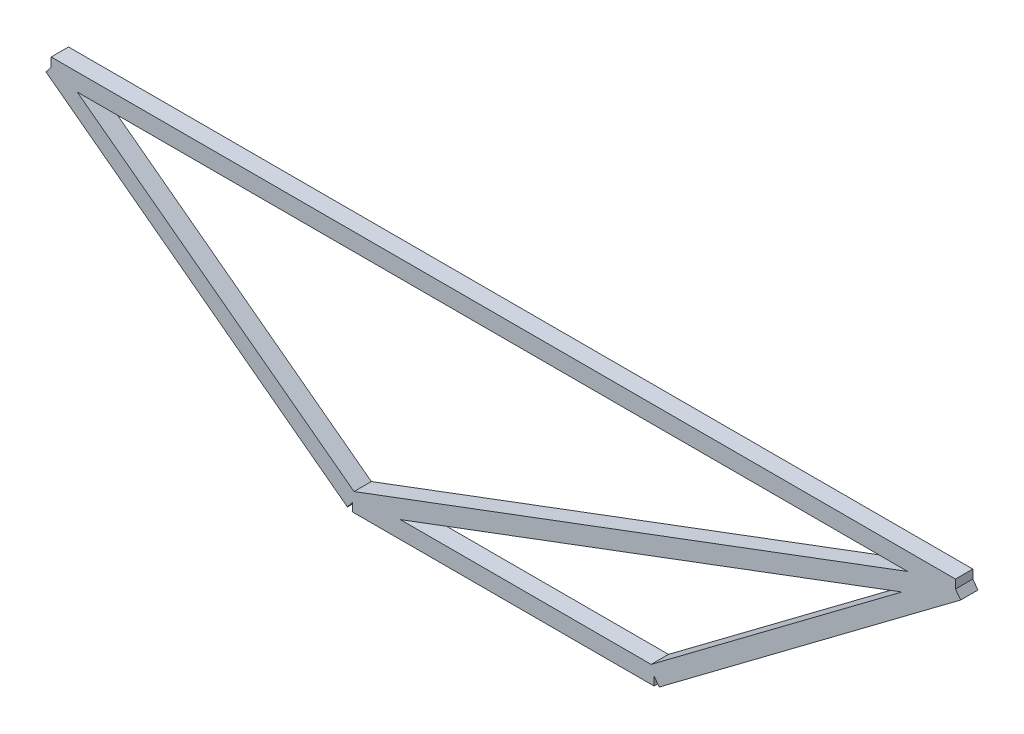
ISO-10303-21;
HEADER;
FILE_DESCRIPTION(('STEP AP214'),'2;1');
FILE_NAME('part.step','',(''),(''),'','','');
FILE_SCHEMA(('AUTOMOTIVE_DESIGN { 1 0 10303 214 1 1 1 1 }'));
ENDSEC;
DATA;
#1=APPLICATION_CONTEXT('core data for automotive mechanical design processes');
#2=APPLICATION_PROTOCOL_DEFINITION('international standard','automotive_design',2000,#1);
#3=PRODUCT_CONTEXT('',#1,'mechanical');
#4=PRODUCT('Part','Part','',(#3));
#5=PRODUCT_RELATED_PRODUCT_CATEGORY('part','',(#4));
#6=PRODUCT_DEFINITION_FORMATION('','',#4);
#7=PRODUCT_DEFINITION_CONTEXT('part definition',#1,'design');
#8=PRODUCT_DEFINITION('design','',#6,#7);
#9=PRODUCT_DEFINITION_SHAPE('','',#8);
#10=(LENGTH_UNIT() NAMED_UNIT(*) SI_UNIT(.MILLI.,.METRE.));
#11=(NAMED_UNIT(*) PLANE_ANGLE_UNIT() SI_UNIT($,.RADIAN.));
#12=(NAMED_UNIT(*) SI_UNIT($,.STERADIAN.) SOLID_ANGLE_UNIT());
#13=UNCERTAINTY_MEASURE_WITH_UNIT(LENGTH_MEASURE(1.E-05),#10,'distance_accuracy_value','');
#14=(GEOMETRIC_REPRESENTATION_CONTEXT(3) GLOBAL_UNCERTAINTY_ASSIGNED_CONTEXT((#13)) GLOBAL_UNIT_ASSIGNED_CONTEXT((#10,
#11,#12)) REPRESENTATION_CONTEXT('',''));
#15=CARTESIAN_POINT('',(0.,0.,0.));
#16=DIRECTION('',(0.,0.,1.));
#17=DIRECTION('',(1.,0.,0.));
#18=AXIS2_PLACEMENT_3D('',#15,#16,#17);
#19=CARTESIAN_POINT('',(1200.,-11.5,23.));
#20=DIRECTION('',(0.,1.,0.));
#21=DIRECTION('',(0.,0.,1.));
#22=AXIS2_PLACEMENT_3D('',#19,#20,#21);
#23=PLANE('',#22);
#24=DIRECTION('',(0.,0.,-1.));
#25=VECTOR('',#24,1.);
#26=CARTESIAN_POINT('',(1136.58131897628,-11.5,23.));
#27=LINE('',#26,#25);
#28=CARTESIAN_POINT('',(1136.58131897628,-11.4999999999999,23.));
#29=VERTEX_POINT('',#28);
#30=CARTESIAN_POINT('',(1136.58131897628,-11.4999999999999,0.));
#31=VERTEX_POINT('',#30);
#32=EDGE_CURVE('E61',#29,#31,#27,.T.);
#33=ORIENTED_EDGE('',*,*,#32,.F.);
#34=DIRECTION('',(1.,0.,0.));
#35=VECTOR('',#34,1.);
#36=CARTESIAN_POINT('',(1200.,-11.5,23.));
#37=LINE('',#36,#35);
#38=CARTESIAN_POINT('',(34.5,-11.5,23.));
#39=VERTEX_POINT('',#38);
#40=EDGE_CURVE('E198',#39,#29,#37,.T.);
#41=ORIENTED_EDGE('',*,*,#40,.F.);
#42=DIRECTION('',(0.,0.,1.));
#43=VECTOR('',#42,1.);
#44=CARTESIAN_POINT('',(34.5,-11.5,23.));
#45=LINE('',#44,#43);
#46=CARTESIAN_POINT('',(34.5,-11.5,0.));
#47=VERTEX_POINT('',#46);
#48=EDGE_CURVE('E179',#47,#39,#45,.T.);
#49=ORIENTED_EDGE('',*,*,#48,.F.);
#50=DIRECTION('',(1.,0.,0.));
#51=VECTOR('',#50,1.);
#52=CARTESIAN_POINT('',(1200.,-11.5,0.));
#53=LINE('',#52,#51);
#54=EDGE_CURVE('E326',#47,#31,#53,.T.);
#55=ORIENTED_EDGE('',*,*,#54,.T.);
#56=EDGE_LOOP('',(#33,#41,#49,#55));
#57=FACE_BOUND('',#56,.T.);
#58=ADVANCED_FACE('F44',(#57),#23,.F.);
#59=CARTESIAN_POINT('',(400.,-288.5,23.));
#60=DIRECTION('',(0.,-1.,0.));
#61=DIRECTION('',(0.,0.,-1.));
#62=AXIS2_PLACEMENT_3D('',#59,#60,#61);
#63=PLANE('',#62);
#64=DIRECTION('',(0.,0.,-1.));
#65=VECTOR('',#64,1.);
#66=CARTESIAN_POINT('',(463.418681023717,-288.5,23.));
#67=LINE('',#66,#65);
#68=CARTESIAN_POINT('',(463.418681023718,-288.5,23.));
#69=VERTEX_POINT('',#68);
#70=CARTESIAN_POINT('',(463.418681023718,-288.5,0.));
#71=VERTEX_POINT('',#70);
#72=EDGE_CURVE('E66',#69,#71,#67,.T.);
#73=ORIENTED_EDGE('',*,*,#72,.F.);
#74=DIRECTION('',(-1.,0.,0.));
#75=VECTOR('',#74,1.);
#76=CARTESIAN_POINT('',(400.,-288.5,23.));
#77=LINE('',#76,#75);
#78=CARTESIAN_POINT('',(796.166666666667,-288.5,23.));
#79=VERTEX_POINT('',#78);
#80=EDGE_CURVE('E257',#79,#69,#77,.T.);
#81=ORIENTED_EDGE('',*,*,#80,.F.);
#82=DIRECTION('',(0.,0.,1.));
#83=VECTOR('',#82,1.);
#84=CARTESIAN_POINT('',(796.166666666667,-288.5,23.));
#85=LINE('',#84,#83);
#86=CARTESIAN_POINT('',(796.166666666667,-288.5,0.));
#87=VERTEX_POINT('',#86);
#88=EDGE_CURVE('E354',#87,#79,#85,.T.);
#89=ORIENTED_EDGE('',*,*,#88,.F.);
#90=DIRECTION('',(-1.,0.,0.));
#91=VECTOR('',#90,1.);
#92=CARTESIAN_POINT('',(400.,-288.5,0.));
#93=LINE('',#92,#91);
#94=EDGE_CURVE('E251',#87,#71,#93,.T.);
#95=ORIENTED_EDGE('',*,*,#94,.T.);
#96=EDGE_LOOP('',(#73,#81,#89,#95));
#97=FACE_BOUND('',#96,.T.);
#98=ADVANCED_FACE('F427',(#97),#63,.F.);
#99=CARTESIAN_POINT('',(6.9,9.2,23.));
#100=DIRECTION('',(-0.6,-0.8,0.));
#101=DIRECTION('',(0.8,-0.6,0.));
#102=AXIS2_PLACEMENT_3D('',#99,#100,#101);
#103=PLANE('',#102);
#104=DIRECTION('',(0.,0.,1.));
#105=VECTOR('',#104,1.);
#106=CARTESIAN_POINT('',(401.860439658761,-287.020329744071,23.));
#107=LINE('',#106,#105);
#108=CARTESIAN_POINT('',(401.860439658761,-287.020329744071,0.));
#109=VERTEX_POINT('',#108);
#110=CARTESIAN_POINT('',(401.860439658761,-287.020329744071,23.));
#111=VERTEX_POINT('',#110);
#112=EDGE_CURVE('E174',#109,#111,#107,.T.);
#113=ORIENTED_EDGE('',*,*,#112,.F.);
#114=DIRECTION('',(-0.8,0.6,0.));
#115=VECTOR('',#114,1.);
#116=CARTESIAN_POINT('',(6.9,9.2,0.));
#117=LINE('',#116,#115);
#118=EDGE_CURVE('E287',#109,#47,#117,.T.);
#119=ORIENTED_EDGE('',*,*,#118,.T.);
#120=ORIENTED_EDGE('',*,*,#48,.T.);
#121=DIRECTION('',(-0.8,0.6,0.));
#122=VECTOR('',#121,1.);
#123=CARTESIAN_POINT('',(6.9,9.2,23.));
#124=LINE('',#123,#122);
#125=EDGE_CURVE('E175',#111,#39,#124,.T.);
#126=ORIENTED_EDGE('',*,*,#125,.F.);
#127=EDGE_LOOP('',(#113,#119,#120,#126));
#128=FACE_BOUND('',#127,.T.);
#129=ADVANCED_FACE('F173',(#128),#103,.F.);
#130=CARTESIAN_POINT('',(793.1,-290.8,23.));
#131=DIRECTION('',(0.6,-0.8,0.));
#132=DIRECTION('',(0.8,0.6,0.));
#133=AXIS2_PLACEMENT_3D('',#130,#131,#132);
#134=PLANE('',#133);
#135=DIRECTION('',(0.,0.,1.));
#136=VECTOR('',#135,1.);
#137=CARTESIAN_POINT('',(1128.91465230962,-38.9390107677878,23.));
#138=LINE('',#137,#136);
#139=CARTESIAN_POINT('',(1128.91465230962,-38.9390107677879,0.));
#140=VERTEX_POINT('',#139);
#141=CARTESIAN_POINT('',(1128.91465230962,-38.9390107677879,23.));
#142=VERTEX_POINT('',#141);
#143=EDGE_CURVE('E11',#140,#142,#138,.T.);
#144=ORIENTED_EDGE('',*,*,#143,.F.);
#145=DIRECTION('',(-0.8,-0.6,0.));
#146=VECTOR('',#145,1.);
#147=CARTESIAN_POINT('',(793.1,-290.8,0.));
#148=LINE('',#147,#146);
#149=EDGE_CURVE('E218',#140,#87,#148,.T.);
#150=ORIENTED_EDGE('',*,*,#149,.T.);
#151=ORIENTED_EDGE('',*,*,#88,.T.);
#152=DIRECTION('',(-0.8,-0.6,0.));
#153=VECTOR('',#152,1.);
#154=CARTESIAN_POINT('',(793.1,-290.8,23.));
#155=LINE('',#154,#153);
#156=EDGE_CURVE('E226',#142,#79,#155,.T.);
#157=ORIENTED_EDGE('',*,*,#156,.F.);
#158=EDGE_LOOP('',(#144,#150,#151,#157));
#159=FACE_BOUND('',#158,.T.);
#160=ADVANCED_FACE('F424',(#159),#134,.F.);
#161=CARTESIAN_POINT('',(1200.,11.5,23.));
#162=DIRECTION('',(-1.,0.,0.));
#163=DIRECTION('',(0.,0.,1.));
#164=AXIS2_PLACEMENT_3D('',#161,#162,#163);
#165=PLANE('',#164);
#166=DIRECTION('',(0.,0.,1.));
#167=VECTOR('',#166,1.);
#168=CARTESIAN_POINT('',(1200.,0.,23.));
#169=LINE('',#168,#167);
#170=CARTESIAN_POINT('',(1200.,0.,0.));
#171=VERTEX_POINT('',#170);
#172=CARTESIAN_POINT('',(1200.,0.,23.));
#173=VERTEX_POINT('',#172);
#174=EDGE_CURVE('E53',#171,#173,#169,.T.);
#175=ORIENTED_EDGE('',*,*,#174,.F.);
#176=DIRECTION('',(0.,1.,0.));
#177=VECTOR('',#176,1.);
#178=CARTESIAN_POINT('',(1200.,11.5,0.));
#179=LINE('',#178,#177);
#180=CARTESIAN_POINT('',(1200.,11.5,0.));
#181=VERTEX_POINT('',#180);
#182=EDGE_CURVE('E328',#171,#181,#179,.T.);
#183=ORIENTED_EDGE('',*,*,#182,.T.);
#184=DIRECTION('',(0.,0.,-1.));
#185=VECTOR('',#184,1.);
#186=CARTESIAN_POINT('',(1200.,11.5,23.));
#187=LINE('',#186,#185);
#188=CARTESIAN_POINT('',(1200.,11.5,23.));
#189=VERTEX_POINT('',#188);
#190=EDGE_CURVE('E340',#189,#181,#187,.T.);
#191=ORIENTED_EDGE('',*,*,#190,.F.);
#192=DIRECTION('',(0.,1.,0.));
#193=VECTOR('',#192,1.);
#194=CARTESIAN_POINT('',(1200.,11.5,23.));
#195=LINE('',#194,#193);
#196=EDGE_CURVE('E320',#173,#189,#195,.T.);
#197=ORIENTED_EDGE('',*,*,#196,.F.);
#198=EDGE_LOOP('',(#175,#183,#191,#197));
#199=FACE_BOUND('',#198,.T.);
#200=ADVANCED_FACE('F379',(#199),#165,.F.);
#201=CARTESIAN_POINT('',(800.,-288.5,23.));
#202=DIRECTION('',(-1.,0.,0.));
#203=DIRECTION('',(0.,0.,1.));
#204=AXIS2_PLACEMENT_3D('',#201,#202,#203);
#205=PLANE('',#204);
#206=DIRECTION('',(0.,0.,-1.));
#207=VECTOR('',#206,1.);
#208=CARTESIAN_POINT('',(800.,-300.,23.));
#209=LINE('',#208,#207);
#210=CARTESIAN_POINT('',(800.,-300.,23.));
#211=VERTEX_POINT('',#210);
#212=CARTESIAN_POINT('',(800.,-300.,0.));
#213=VERTEX_POINT('',#212);
#214=EDGE_CURVE('E351',#211,#213,#209,.T.);
#215=ORIENTED_EDGE('',*,*,#214,.F.);
#216=DIRECTION('',(0.,1.,0.));
#217=VECTOR('',#216,1.);
#218=CARTESIAN_POINT('',(800.,-288.5,23.));
#219=LINE('',#218,#217);
#220=CARTESIAN_POINT('',(800.,-311.5,23.));
#221=VERTEX_POINT('',#220);
#222=EDGE_CURVE('E258',#221,#211,#219,.T.);
#223=ORIENTED_EDGE('',*,*,#222,.F.);
#224=DIRECTION('',(0.,0.,-1.));
#225=VECTOR('',#224,1.);
#226=CARTESIAN_POINT('',(800.,-311.5,23.));
#227=LINE('',#226,#225);
#228=CARTESIAN_POINT('',(800.,-311.5,0.));
#229=VERTEX_POINT('',#228);
#230=EDGE_CURVE('E263',#221,#229,#227,.T.);
#231=ORIENTED_EDGE('',*,*,#230,.T.);
#232=DIRECTION('',(0.,1.,0.));
#233=VECTOR('',#232,1.);
#234=CARTESIAN_POINT('',(800.,-288.5,0.));
#235=LINE('',#234,#233);
#236=EDGE_CURVE('E267',#229,#213,#235,.T.);
#237=ORIENTED_EDGE('',*,*,#236,.T.);
#238=EDGE_LOOP('',(#215,#223,#231,#237));
#239=FACE_BOUND('',#238,.T.);
#240=ADVANCED_FACE('F411',(#239),#205,.F.);
#241=CARTESIAN_POINT('',(406.9,-290.8,23.));
#242=DIRECTION('',(-0.799999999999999,0.600000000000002,0.));
#243=DIRECTION('',(-0.600000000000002,-0.799999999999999,0.));
#244=AXIS2_PLACEMENT_3D('',#241,#242,#243);
#245=PLANE('',#244);
#246=DIRECTION('',(0.,0.,-1.));
#247=VECTOR('',#246,1.);
#248=CARTESIAN_POINT('',(400.,-300.,23.));
#249=LINE('',#248,#247);
#250=CARTESIAN_POINT('',(400.,-300.,23.));
#251=VERTEX_POINT('',#250);
#252=CARTESIAN_POINT('',(400.,-300.,0.));
#253=VERTEX_POINT('',#252);
#254=EDGE_CURVE('E350',#251,#253,#249,.T.);
#255=ORIENTED_EDGE('',*,*,#254,.F.);
#256=DIRECTION('',(0.600000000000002,0.799999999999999,0.));
#257=VECTOR('',#256,1.);
#258=CARTESIAN_POINT('',(406.9,-290.8,23.));
#259=LINE('',#258,#257);
#260=CARTESIAN_POINT('',(393.1,-309.2,23.));
#261=VERTEX_POINT('',#260);
#262=EDGE_CURVE('E181',#261,#251,#259,.T.);
#263=ORIENTED_EDGE('',*,*,#262,.F.);
#264=DIRECTION('',(0.,0.,-1.));
#265=VECTOR('',#264,1.);
#266=CARTESIAN_POINT('',(393.1,-309.2,23.));
#267=LINE('',#266,#265);
#268=CARTESIAN_POINT('',(393.1,-309.2,0.));
#269=VERTEX_POINT('',#268);
#270=EDGE_CURVE('E185',#261,#269,#267,.T.);
#271=ORIENTED_EDGE('',*,*,#270,.T.);
#272=DIRECTION('',(0.600000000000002,0.799999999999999,0.));
#273=VECTOR('',#272,1.);
#274=CARTESIAN_POINT('',(406.9,-290.8,0.));
#275=LINE('',#274,#273);
#276=EDGE_CURVE('E300',#269,#253,#275,.T.);
#277=ORIENTED_EDGE('',*,*,#276,.T.);
#278=EDGE_LOOP('',(#255,#263,#271,#277));
#279=FACE_BOUND('',#278,.T.);
#280=ADVANCED_FACE('F418',(#279),#245,.F.);
#281=CARTESIAN_POINT('',(0.,-11.5,23.));
#282=DIRECTION('',(1.,0.,0.));
#283=DIRECTION('',(0.,0.,-1.));
#284=AXIS2_PLACEMENT_3D('',#281,#282,#283);
#285=PLANE('',#284);
#286=DIRECTION('',(0.,0.,-1.));
#287=VECTOR('',#286,1.);
#288=CARTESIAN_POINT('',(0.,0.,23.));
#289=LINE('',#288,#287);
#290=CARTESIAN_POINT('',(0.,0.,23.));
#291=VERTEX_POINT('',#290);
#292=CARTESIAN_POINT('',(0.,0.,0.));
#293=VERTEX_POINT('',#292);
#294=EDGE_CURVE('E344',#291,#293,#289,.T.);
#295=ORIENTED_EDGE('',*,*,#294,.F.);
#296=DIRECTION('',(0.,-1.,0.));
#297=VECTOR('',#296,1.);
#298=CARTESIAN_POINT('',(0.,-11.5,23.));
#299=LINE('',#298,#297);
#300=CARTESIAN_POINT('',(0.,11.5,23.));
#301=VERTEX_POINT('',#300);
#302=EDGE_CURVE('E309',#301,#291,#299,.T.);
#303=ORIENTED_EDGE('',*,*,#302,.F.);
#304=DIRECTION('',(0.,0.,-1.));
#305=VECTOR('',#304,1.);
#306=CARTESIAN_POINT('',(0.,11.5,23.));
#307=LINE('',#306,#305);
#308=CARTESIAN_POINT('',(0.,11.5,0.));
#309=VERTEX_POINT('',#308);
#310=EDGE_CURVE('E323',#301,#309,#307,.T.);
#311=ORIENTED_EDGE('',*,*,#310,.T.);
#312=DIRECTION('',(0.,-1.,0.));
#313=VECTOR('',#312,1.);
#314=CARTESIAN_POINT('',(0.,-11.5,0.));
#315=LINE('',#314,#313);
#316=EDGE_CURVE('E310',#309,#293,#315,.T.);
#317=ORIENTED_EDGE('',*,*,#316,.T.);
#318=EDGE_LOOP('',(#295,#303,#311,#317));
#319=FACE_BOUND('',#318,.T.);
#320=ADVANCED_FACE('F50',(#319),#285,.F.);
#321=CARTESIAN_POINT('',(0.,11.5,23.));
#322=DIRECTION('',(0.,-1.,0.));
#323=DIRECTION('',(0.,0.,-1.));
#324=AXIS2_PLACEMENT_3D('',#321,#322,#323);
#325=PLANE('',#324);
#326=DIRECTION('',(-1.,0.,0.));
#327=VECTOR('',#326,1.);
#328=CARTESIAN_POINT('',(0.,11.5,0.));
#329=LINE('',#328,#327);
#330=EDGE_CURVE('E314',#181,#309,#329,.T.);
#331=ORIENTED_EDGE('',*,*,#330,.T.);
#332=ORIENTED_EDGE('',*,*,#310,.F.);
#333=DIRECTION('',(-1.,0.,0.));
#334=VECTOR('',#333,1.);
#335=CARTESIAN_POINT('',(0.,11.5,23.));
#336=LINE('',#335,#334);
#337=EDGE_CURVE('E319',#189,#301,#336,.T.);
#338=ORIENTED_EDGE('',*,*,#337,.F.);
#339=ORIENTED_EDGE('',*,*,#190,.T.);
#340=EDGE_LOOP('',(#331,#332,#338,#339));
#341=FACE_BOUND('',#340,.T.);
#342=ADVANCED_FACE('F382',(#341),#325,.F.);
#343=CARTESIAN_POINT('',(0.,0.,23.));
#344=DIRECTION('',(0.,0.,-1.));
#345=DIRECTION('',(-1.,0.,0.));
#346=AXIS2_PLACEMENT_3D('',#343,#344,#345);
#347=PLANE('',#346);
#348=DIRECTION('',(0.936329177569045,0.351123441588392,0.));
#349=VECTOR('',#348,1.);
#350=CARTESIAN_POINT('',(1204.03791957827,-10.767785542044,23.));
#351=LINE('',#350,#349);
#352=EDGE_CURVE('E196',#69,#142,#351,.T.);
#353=ORIENTED_EDGE('',*,*,#352,.T.);
#354=ORIENTED_EDGE('',*,*,#156,.T.);
#355=ORIENTED_EDGE('',*,*,#80,.T.);
#356=EDGE_LOOP('',(#353,#354,#355));
#357=FACE_BOUND('',#356,.T.);
#358=DIRECTION('',(-0.936329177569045,-0.351123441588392,0.));
#359=VECTOR('',#358,1.);
#360=CARTESIAN_POINT('',(395.962080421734,-289.232214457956,23.));
#361=LINE('',#360,#359);
#362=EDGE_CURVE('E188',#29,#111,#361,.T.);
#363=ORIENTED_EDGE('',*,*,#362,.T.);
#364=ORIENTED_EDGE('',*,*,#125,.T.);
#365=ORIENTED_EDGE('',*,*,#40,.T.);
#366=EDGE_LOOP('',(#363,#364,#365));
#367=FACE_BOUND('',#366,.T.);
#368=DIRECTION('',(-0.599999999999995,0.800000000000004,0.));
#369=VECTOR('',#368,1.);
#370=CARTESIAN_POINT('',(1193.1,9.2,23.));
#371=LINE('',#370,#369);
#372=CARTESIAN_POINT('',(1206.9,-9.2,23.));
#373=VERTEX_POINT('',#372);
#374=EDGE_CURVE('E225',#373,#173,#371,.T.);
#375=ORIENTED_EDGE('',*,*,#374,.T.);
#376=ORIENTED_EDGE('',*,*,#196,.T.);
#377=ORIENTED_EDGE('',*,*,#337,.T.);
#378=ORIENTED_EDGE('',*,*,#302,.T.);
#379=DIRECTION('',(-0.6,-0.8,0.));
#380=VECTOR('',#379,1.);
#381=CARTESIAN_POINT('',(-6.9,-9.2,23.));
#382=LINE('',#381,#380);
#383=CARTESIAN_POINT('',(-6.9,-9.2,23.));
#384=VERTEX_POINT('',#383);
#385=EDGE_CURVE('E285',#291,#384,#382,.T.);
#386=ORIENTED_EDGE('',*,*,#385,.T.);
#387=DIRECTION('',(0.8,-0.6,0.));
#388=VECTOR('',#387,1.);
#389=CARTESIAN_POINT('',(393.1,-309.2,23.));
#390=LINE('',#389,#388);
#391=EDGE_CURVE('E284',#384,#261,#390,.T.);
#392=ORIENTED_EDGE('',*,*,#391,.T.);
#393=ORIENTED_EDGE('',*,*,#262,.T.);
#394=DIRECTION('',(0.,-1.,0.));
#395=VECTOR('',#394,1.);
#396=CARTESIAN_POINT('',(400.,-311.5,23.));
#397=LINE('',#396,#395);
#398=CARTESIAN_POINT('',(400.,-311.5,23.));
#399=VERTEX_POINT('',#398);
#400=EDGE_CURVE('E246',#251,#399,#397,.T.);
#401=ORIENTED_EDGE('',*,*,#400,.T.);
#402=DIRECTION('',(1.,0.,0.));
#403=VECTOR('',#402,1.);
#404=CARTESIAN_POINT('',(800.,-311.5,23.));
#405=LINE('',#404,#403);
#406=EDGE_CURVE('E252',#399,#221,#405,.T.);
#407=ORIENTED_EDGE('',*,*,#406,.T.);
#408=ORIENTED_EDGE('',*,*,#222,.T.);
#409=DIRECTION('',(0.600000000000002,-0.799999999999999,0.));
#410=VECTOR('',#409,1.);
#411=CARTESIAN_POINT('',(806.9,-309.2,23.));
#412=LINE('',#411,#410);
#413=CARTESIAN_POINT('',(806.9,-309.2,23.));
#414=VERTEX_POINT('',#413);
#415=EDGE_CURVE('E214',#211,#414,#412,.T.);
#416=ORIENTED_EDGE('',*,*,#415,.T.);
#417=DIRECTION('',(0.8,0.6,0.));
#418=VECTOR('',#417,1.);
#419=CARTESIAN_POINT('',(1206.9,-9.2,23.));
#420=LINE('',#419,#418);
#421=EDGE_CURVE('E217',#414,#373,#420,.T.);
#422=ORIENTED_EDGE('',*,*,#421,.T.);
#423=EDGE_LOOP('',(#375,#376,#377,#378,#386,#392,#393,#401,#407,#408,#416,#422));
#424=FACE_BOUND('',#423,.T.);
#425=ADVANCED_FACE('F191',(#357,#367,#424),#347,.F.);
#426=CARTESIAN_POINT('',(0.,0.,0.));
#427=DIRECTION('',(0.,0.,-1.));
#428=DIRECTION('',(-1.,0.,0.));
#429=AXIS2_PLACEMENT_3D('',#426,#427,#428);
#430=PLANE('',#429);
#431=ORIENTED_EDGE('',*,*,#149,.F.);
#432=DIRECTION('',(0.936329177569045,0.351123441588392,0.));
#433=VECTOR('',#432,1.);
#434=CARTESIAN_POINT('',(1204.03791957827,-10.767785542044,0.));
#435=LINE('',#434,#433);
#436=EDGE_CURVE('E200',#71,#140,#435,.T.);
#437=ORIENTED_EDGE('',*,*,#436,.F.);
#438=ORIENTED_EDGE('',*,*,#94,.F.);
#439=EDGE_LOOP('',(#431,#437,#438));
#440=FACE_BOUND('',#439,.T.);
#441=ORIENTED_EDGE('',*,*,#182,.F.);
#442=DIRECTION('',(-0.599999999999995,0.800000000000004,0.));
#443=VECTOR('',#442,1.);
#444=CARTESIAN_POINT('',(1193.1,9.2,0.));
#445=LINE('',#444,#443);
#446=CARTESIAN_POINT('',(1206.9,-9.2,0.));
#447=VERTEX_POINT('',#446);
#448=EDGE_CURVE('E233',#447,#171,#445,.T.);
#449=ORIENTED_EDGE('',*,*,#448,.F.);
#450=DIRECTION('',(0.8,0.6,0.));
#451=VECTOR('',#450,1.);
#452=CARTESIAN_POINT('',(1206.9,-9.2,0.));
#453=LINE('',#452,#451);
#454=CARTESIAN_POINT('',(806.9,-309.2,0.));
#455=VERTEX_POINT('',#454);
#456=EDGE_CURVE('E235',#455,#447,#453,.T.);
#457=ORIENTED_EDGE('',*,*,#456,.F.);
#458=DIRECTION('',(0.600000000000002,-0.799999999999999,0.));
#459=VECTOR('',#458,1.);
#460=CARTESIAN_POINT('',(806.9,-309.2,0.));
#461=LINE('',#460,#459);
#462=EDGE_CURVE('E212',#213,#455,#461,.T.);
#463=ORIENTED_EDGE('',*,*,#462,.F.);
#464=ORIENTED_EDGE('',*,*,#236,.F.);
#465=DIRECTION('',(1.,0.,0.));
#466=VECTOR('',#465,1.);
#467=CARTESIAN_POINT('',(800.,-311.5,0.));
#468=LINE('',#467,#466);
#469=CARTESIAN_POINT('',(400.,-311.5,0.));
#470=VERTEX_POINT('',#469);
#471=EDGE_CURVE('E266',#470,#229,#468,.T.);
#472=ORIENTED_EDGE('',*,*,#471,.F.);
#473=DIRECTION('',(0.,-1.,0.));
#474=VECTOR('',#473,1.);
#475=CARTESIAN_POINT('',(400.,-311.5,0.));
#476=LINE('',#475,#474);
#477=EDGE_CURVE('E249',#253,#470,#476,.T.);
#478=ORIENTED_EDGE('',*,*,#477,.F.);
#479=ORIENTED_EDGE('',*,*,#276,.F.);
#480=DIRECTION('',(0.8,-0.6,0.));
#481=VECTOR('',#480,1.);
#482=CARTESIAN_POINT('',(393.1,-309.2,0.));
#483=LINE('',#482,#481);
#484=CARTESIAN_POINT('',(-6.9,-9.2,0.));
#485=VERTEX_POINT('',#484);
#486=EDGE_CURVE('E294',#485,#269,#483,.T.);
#487=ORIENTED_EDGE('',*,*,#486,.F.);
#488=DIRECTION('',(-0.6,-0.8,0.));
#489=VECTOR('',#488,1.);
#490=CARTESIAN_POINT('',(-6.9,-9.2,0.));
#491=LINE('',#490,#489);
#492=EDGE_CURVE('E281',#293,#485,#491,.T.);
#493=ORIENTED_EDGE('',*,*,#492,.F.);
#494=ORIENTED_EDGE('',*,*,#316,.F.);
#495=ORIENTED_EDGE('',*,*,#330,.F.);
#496=EDGE_LOOP('',(#441,#449,#457,#463,#464,#472,#478,#479,#487,#493,#494,#495));
#497=FACE_BOUND('',#496,.T.);
#498=DIRECTION('',(-0.936329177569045,-0.351123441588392,0.));
#499=VECTOR('',#498,1.);
#500=CARTESIAN_POINT('',(395.962080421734,-289.232214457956,0.));
#501=LINE('',#500,#499);
#502=EDGE_CURVE('E192',#31,#109,#501,.T.);
#503=ORIENTED_EDGE('',*,*,#502,.F.);
#504=ORIENTED_EDGE('',*,*,#54,.F.);
#505=ORIENTED_EDGE('',*,*,#118,.F.);
#506=EDGE_LOOP('',(#503,#504,#505));
#507=FACE_BOUND('',#506,.T.);
#508=ADVANCED_FACE('F374',(#440,#497,#507),#430,.T.);
#509=CARTESIAN_POINT('',(-6.9,-9.2,23.));
#510=DIRECTION('',(0.8,-0.6,0.));
#511=DIRECTION('',(0.6,0.8,0.));
#512=AXIS2_PLACEMENT_3D('',#509,#510,#511);
#513=PLANE('',#512);
#514=ORIENTED_EDGE('',*,*,#385,.F.);
#515=ORIENTED_EDGE('',*,*,#294,.T.);
#516=ORIENTED_EDGE('',*,*,#492,.T.);
#517=DIRECTION('',(0.,0.,-1.));
#518=VECTOR('',#517,1.);
#519=CARTESIAN_POINT('',(-6.9,-9.2,23.));
#520=LINE('',#519,#518);
#521=EDGE_CURVE('E303',#384,#485,#520,.T.);
#522=ORIENTED_EDGE('',*,*,#521,.F.);
#523=EDGE_LOOP('',(#514,#515,#516,#522));
#524=FACE_BOUND('',#523,.T.);
#525=ADVANCED_FACE('F391',(#524),#513,.F.);
#526=CARTESIAN_POINT('',(393.1,-309.2,23.));
#527=DIRECTION('',(0.6,0.8,0.));
#528=DIRECTION('',(-0.8,0.6,0.));
#529=AXIS2_PLACEMENT_3D('',#526,#527,#528);
#530=PLANE('',#529);
#531=ORIENTED_EDGE('',*,*,#486,.T.);
#532=ORIENTED_EDGE('',*,*,#270,.F.);
#533=ORIENTED_EDGE('',*,*,#391,.F.);
#534=ORIENTED_EDGE('',*,*,#521,.T.);
#535=EDGE_LOOP('',(#531,#532,#533,#534));
#536=FACE_BOUND('',#535,.T.);
#537=ADVANCED_FACE('F394',(#536),#530,.F.);
#538=CARTESIAN_POINT('',(400.,-311.5,23.));
#539=DIRECTION('',(1.,0.,0.));
#540=DIRECTION('',(0.,0.,-1.));
#541=AXIS2_PLACEMENT_3D('',#538,#539,#540);
#542=PLANE('',#541);
#543=ORIENTED_EDGE('',*,*,#400,.F.);
#544=ORIENTED_EDGE('',*,*,#254,.T.);
#545=ORIENTED_EDGE('',*,*,#477,.T.);
#546=DIRECTION('',(0.,0.,-1.));
#547=VECTOR('',#546,1.);
#548=CARTESIAN_POINT('',(400.,-311.5,23.));
#549=LINE('',#548,#547);
#550=EDGE_CURVE('E280',#399,#470,#549,.T.);
#551=ORIENTED_EDGE('',*,*,#550,.F.);
#552=EDGE_LOOP('',(#543,#544,#545,#551));
#553=FACE_BOUND('',#552,.T.);
#554=ADVANCED_FACE('F401',(#553),#542,.F.);
#555=CARTESIAN_POINT('',(800.,-311.5,23.));
#556=DIRECTION('',(0.,1.,0.));
#557=DIRECTION('',(0.,0.,1.));
#558=AXIS2_PLACEMENT_3D('',#555,#556,#557);
#559=PLANE('',#558);
#560=ORIENTED_EDGE('',*,*,#471,.T.);
#561=ORIENTED_EDGE('',*,*,#230,.F.);
#562=ORIENTED_EDGE('',*,*,#406,.F.);
#563=ORIENTED_EDGE('',*,*,#550,.T.);
#564=EDGE_LOOP('',(#560,#561,#562,#563));
#565=FACE_BOUND('',#564,.T.);
#566=ADVANCED_FACE('F410',(#565),#559,.F.);
#567=CARTESIAN_POINT('',(1193.1,9.2,23.));
#568=DIRECTION('',(-0.800000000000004,-0.599999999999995,0.));
#569=DIRECTION('',(0.599999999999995,-0.800000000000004,0.));
#570=AXIS2_PLACEMENT_3D('',#567,#568,#569);
#571=PLANE('',#570);
#572=ORIENTED_EDGE('',*,*,#448,.T.);
#573=ORIENTED_EDGE('',*,*,#174,.T.);
#574=ORIENTED_EDGE('',*,*,#374,.F.);
#575=DIRECTION('',(0.,0.,-1.));
#576=VECTOR('',#575,1.);
#577=CARTESIAN_POINT('',(1206.9,-9.2,23.));
#578=LINE('',#577,#576);
#579=EDGE_CURVE('E228',#373,#447,#578,.T.);
#580=ORIENTED_EDGE('',*,*,#579,.T.);
#581=EDGE_LOOP('',(#572,#573,#574,#580));
#582=FACE_BOUND('',#581,.T.);
#583=ADVANCED_FACE('F362',(#582),#571,.F.);
#584=CARTESIAN_POINT('',(806.9,-309.2,23.));
#585=DIRECTION('',(0.799999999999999,0.600000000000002,0.));
#586=DIRECTION('',(-0.600000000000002,0.799999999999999,0.));
#587=AXIS2_PLACEMENT_3D('',#584,#585,#586);
#588=PLANE('',#587);
#589=ORIENTED_EDGE('',*,*,#415,.F.);
#590=ORIENTED_EDGE('',*,*,#214,.T.);
#591=ORIENTED_EDGE('',*,*,#462,.T.);
#592=DIRECTION('',(0.,0.,-1.));
#593=VECTOR('',#592,1.);
#594=CARTESIAN_POINT('',(806.9,-309.2,23.));
#595=LINE('',#594,#593);
#596=EDGE_CURVE('E243',#414,#455,#595,.T.);
#597=ORIENTED_EDGE('',*,*,#596,.F.);
#598=EDGE_LOOP('',(#589,#590,#591,#597));
#599=FACE_BOUND('',#598,.T.);
#600=ADVANCED_FACE('F415',(#599),#588,.F.);
#601=CARTESIAN_POINT('',(1206.9,-9.2,23.));
#602=DIRECTION('',(-0.6,0.8,0.));
#603=DIRECTION('',(-0.8,-0.6,0.));
#604=AXIS2_PLACEMENT_3D('',#601,#602,#603);
#605=PLANE('',#604);
#606=ORIENTED_EDGE('',*,*,#456,.T.);
#607=ORIENTED_EDGE('',*,*,#579,.F.);
#608=ORIENTED_EDGE('',*,*,#421,.F.);
#609=ORIENTED_EDGE('',*,*,#596,.T.);
#610=EDGE_LOOP('',(#606,#607,#608,#609));
#611=FACE_BOUND('',#610,.T.);
#612=ADVANCED_FACE('F375',(#611),#605,.F.);
#613=CARTESIAN_POINT('',(395.962080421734,-289.232214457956,23.));
#614=DIRECTION('',(0.351123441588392,-0.936329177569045,0.));
#615=DIRECTION('',(0.936329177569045,0.351123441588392,0.));
#616=AXIS2_PLACEMENT_3D('',#613,#614,#615);
#617=PLANE('',#616);
#618=ORIENTED_EDGE('',*,*,#362,.F.);
#619=ORIENTED_EDGE('',*,*,#32,.T.);
#620=ORIENTED_EDGE('',*,*,#502,.T.);
#621=ORIENTED_EDGE('',*,*,#112,.T.);
#622=EDGE_LOOP('',(#618,#619,#620,#621));
#623=FACE_BOUND('',#622,.T.);
#624=ADVANCED_FACE('F187',(#623),#617,.F.);
#625=CARTESIAN_POINT('',(1204.03791957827,-10.767785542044,23.));
#626=DIRECTION('',(-0.351123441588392,0.936329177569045,0.));
#627=DIRECTION('',(-0.936329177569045,-0.351123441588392,0.));
#628=AXIS2_PLACEMENT_3D('',#625,#626,#627);
#629=PLANE('',#628);
#630=ORIENTED_EDGE('',*,*,#352,.F.);
#631=ORIENTED_EDGE('',*,*,#72,.T.);
#632=ORIENTED_EDGE('',*,*,#436,.T.);
#633=ORIENTED_EDGE('',*,*,#143,.T.);
#634=EDGE_LOOP('',(#630,#631,#632,#633));
#635=FACE_BOUND('',#634,.T.);
#636=ADVANCED_FACE('F463',(#635),#629,.F.);
#637=CLOSED_SHELL('',(#58,#98,#129,#160,#200,#240,#280,#320,#342,#425,#508,#525,#537,#554,#566,
#583,#600,#612,#624,#636));
#638=MANIFOLD_SOLID_BREP('B2',#637);
#639=ADVANCED_BREP_SHAPE_REPRESENTATION('',(#18,#638),#14);
#640=SHAPE_DEFINITION_REPRESENTATION(#9,#639);
ENDSEC;
END-ISO-10303-21;
